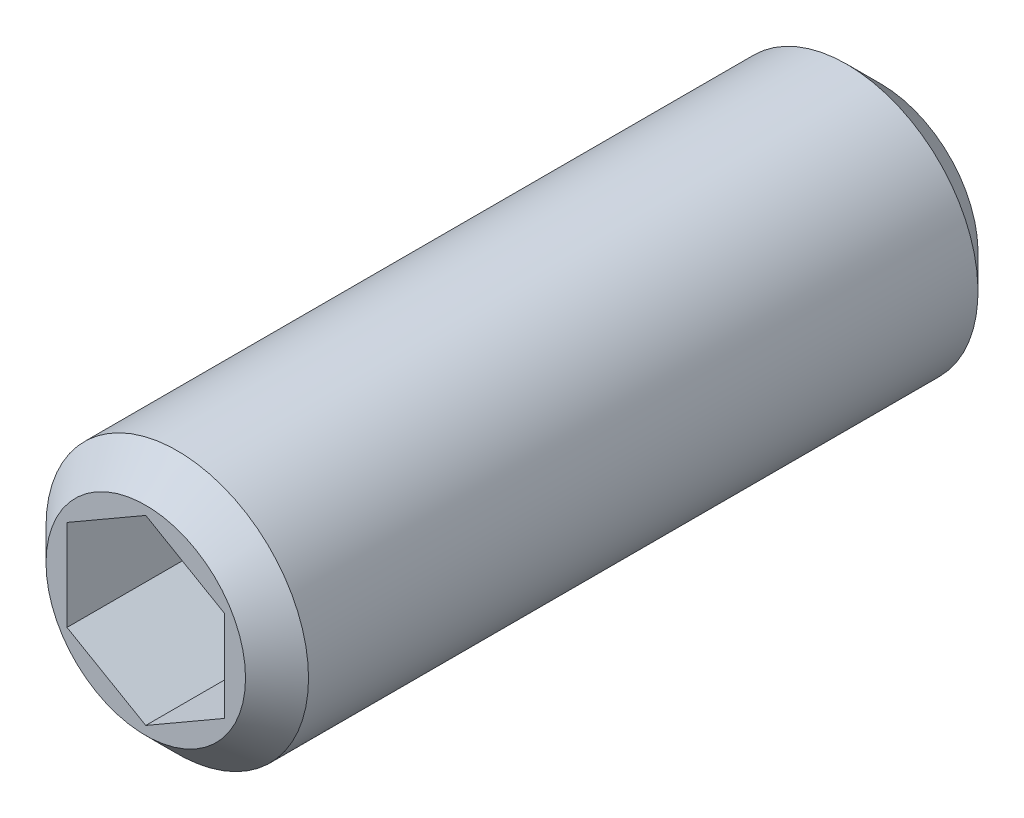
ISO-10303-21;
HEADER;
FILE_DESCRIPTION(('STEP AP214'),'2;1');
FILE_NAME('part.step','',(''),(''),'','','');
FILE_SCHEMA(('AUTOMOTIVE_DESIGN { 1 0 10303 214 1 1 1 1 }'));
ENDSEC;
DATA;
#1=APPLICATION_CONTEXT('core data for automotive mechanical design processes');
#2=APPLICATION_PROTOCOL_DEFINITION('international standard','automotive_design',2000,#1);
#3=PRODUCT_CONTEXT('',#1,'mechanical');
#4=PRODUCT('Part','Part','',(#3));
#5=PRODUCT_RELATED_PRODUCT_CATEGORY('part','',(#4));
#6=PRODUCT_DEFINITION_FORMATION('','',#4);
#7=PRODUCT_DEFINITION_CONTEXT('part definition',#1,'design');
#8=PRODUCT_DEFINITION('design','',#6,#7);
#9=PRODUCT_DEFINITION_SHAPE('','',#8);
#10=(LENGTH_UNIT() NAMED_UNIT(*) SI_UNIT(.MILLI.,.METRE.));
#11=(NAMED_UNIT(*) PLANE_ANGLE_UNIT() SI_UNIT($,.RADIAN.));
#12=(NAMED_UNIT(*) SI_UNIT($,.STERADIAN.) SOLID_ANGLE_UNIT());
#13=UNCERTAINTY_MEASURE_WITH_UNIT(LENGTH_MEASURE(1.E-05),#10,'distance_accuracy_value','');
#14=(GEOMETRIC_REPRESENTATION_CONTEXT(3) GLOBAL_UNCERTAINTY_ASSIGNED_CONTEXT((#13)) GLOBAL_UNIT_ASSIGNED_CONTEXT((#10,
#11,#12)) REPRESENTATION_CONTEXT('',''));
#15=CARTESIAN_POINT('',(0.,0.,0.));
#16=DIRECTION('',(0.,0.,1.));
#17=DIRECTION('',(1.,0.,0.));
#18=AXIS2_PLACEMENT_3D('',#15,#16,#17);
#19=CARTESIAN_POINT('',(0.,0.,0.9));
#20=DIRECTION('',(0.,0.,1.));
#21=DIRECTION('',(0.,-1.,0.));
#22=AXIS2_PLACEMENT_3D('',#19,#20,#21);
#23=CYLINDRICAL_SURFACE('',#22,2.5);
#24=CARTESIAN_POINT('',(0.,0.,14.3));
#25=DIRECTION('',(0.,0.,-1.));
#26=DIRECTION('',(-1.,0.,0.));
#27=AXIS2_PLACEMENT_3D('',#24,#25,#26);
#28=CIRCLE('',#27,2.5);
#29=CARTESIAN_POINT('',(-2.5,0.,14.3));
#30=VERTEX_POINT('',#29);
#31=EDGE_CURVE('E22',#30,#30,#28,.T.);
#32=ORIENTED_EDGE('',*,*,#31,.T.);
#33=EDGE_LOOP('',(#32));
#34=FACE_BOUND('',#33,.T.);
#35=CARTESIAN_POINT('',(0.,0.,1.55));
#36=DIRECTION('',(0.,0.,-1.));
#37=DIRECTION('',(-1.,0.,0.));
#38=AXIS2_PLACEMENT_3D('',#35,#36,#37);
#39=CIRCLE('',#38,2.5);
#40=CARTESIAN_POINT('',(-2.5,0.,1.55));
#41=VERTEX_POINT('',#40);
#42=EDGE_CURVE('E181',#41,#41,#39,.T.);
#43=ORIENTED_EDGE('',*,*,#42,.F.);
#44=EDGE_LOOP('',(#43));
#45=FACE_BOUND('',#44,.T.);
#46=ADVANCED_FACE('F14',(#34,#45),#23,.T.);
#47=CARTESIAN_POINT('',(0.,0.,0.9));
#48=DIRECTION('',(0.,0.,1.));
#49=DIRECTION('',(1.,0.,0.));
#50=AXIS2_PLACEMENT_3D('',#47,#48,#49);
#51=CONICAL_SURFACE('',#50,1.85,0.785398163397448);
#52=ORIENTED_EDGE('',*,*,#42,.T.);
#53=EDGE_LOOP('',(#52));
#54=FACE_BOUND('',#53,.T.);
#55=CARTESIAN_POINT('',(0.,0.,0.9));
#56=DIRECTION('',(0.,0.,-1.));
#57=DIRECTION('',(0.,1.,0.));
#58=AXIS2_PLACEMENT_3D('',#55,#56,#57);
#59=CIRCLE('',#58,1.85);
#60=CARTESIAN_POINT('',(0.,1.85,0.9));
#61=VERTEX_POINT('',#60);
#62=EDGE_CURVE('E116',#61,#61,#59,.F.);
#63=ORIENTED_EDGE('',*,*,#62,.T.);
#64=EDGE_LOOP('',(#63));
#65=FACE_BOUND('',#64,.T.);
#66=ADVANCED_FACE('F142',(#54,#65),#51,.T.);
#67=CARTESIAN_POINT('',(0.,0.,1.5));
#68=DIRECTION('',(0.,0.,-1.));
#69=DIRECTION('',(1.,0.,0.));
#70=AXIS2_PLACEMENT_3D('',#67,#68,#69);
#71=SPHERICAL_SURFACE('',#70,1.5);
#72=CARTESIAN_POINT('',(0.,0.,0.9));
#73=DIRECTION('',(0.,0.,-1.));
#74=DIRECTION('',(0.,1.,0.));
#75=AXIS2_PLACEMENT_3D('',#72,#73,#74);
#76=CIRCLE('',#75,1.37477270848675);
#77=CARTESIAN_POINT('',(0.,1.37477270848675,0.9));
#78=VERTEX_POINT('',#77);
#79=EDGE_CURVE('E123',#78,#78,#76,.F.);
#80=ORIENTED_EDGE('',*,*,#79,.F.);
#81=EDGE_LOOP('',(#80));
#82=FACE_BOUND('',#81,.T.);
#83=ADVANCED_FACE('F146',(#82),#71,.T.);
#84=CARTESIAN_POINT('',(0.,0.,0.9));
#85=DIRECTION('',(0.,0.,-1.));
#86=DIRECTION('',(0.,1.,0.));
#87=AXIS2_PLACEMENT_3D('',#84,#85,#86);
#88=PLANE('',#87);
#89=ORIENTED_EDGE('',*,*,#62,.F.);
#90=EDGE_LOOP('',(#89));
#91=FACE_BOUND('',#90,.T.);
#92=ORIENTED_EDGE('',*,*,#79,.T.);
#93=EDGE_LOOP('',(#92));
#94=FACE_BOUND('',#93,.T.);
#95=ADVANCED_FACE('F150',(#91,#94),#88,.T.);
#96=CARTESIAN_POINT('',(-1.5,-0.866025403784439,11.9));
#97=DIRECTION('',(0.,0.,-1.));
#98=DIRECTION('',(0.,1.,0.));
#99=AXIS2_PLACEMENT_3D('',#96,#97,#98);
#100=PLANE('',#99);
#101=DIRECTION('',(0.866025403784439,-0.5,0.));
#102=VECTOR('',#101,1.);
#103=CARTESIAN_POINT('',(-1.5,-0.866025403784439,11.9));
#104=LINE('',#103,#102);
#105=CARTESIAN_POINT('',(-1.5,-0.866025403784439,11.9));
#106=VERTEX_POINT('',#105);
#107=CARTESIAN_POINT('',(0.,-1.73205080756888,11.9));
#108=VERTEX_POINT('',#107);
#109=EDGE_CURVE('E100',#106,#108,#104,.T.);
#110=ORIENTED_EDGE('',*,*,#109,.T.);
#111=DIRECTION('',(0.866025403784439,0.5,0.));
#112=VECTOR('',#111,1.);
#113=CARTESIAN_POINT('',(0.,-1.73205080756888,11.9));
#114=LINE('',#113,#112);
#115=CARTESIAN_POINT('',(1.5,-0.866025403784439,11.9));
#116=VERTEX_POINT('',#115);
#117=EDGE_CURVE('E103',#108,#116,#114,.T.);
#118=ORIENTED_EDGE('',*,*,#117,.T.);
#119=DIRECTION('',(0.,1.,0.));
#120=VECTOR('',#119,1.);
#121=CARTESIAN_POINT('',(1.5,-0.866025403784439,11.9));
#122=LINE('',#121,#120);
#123=CARTESIAN_POINT('',(1.5,0.866025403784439,11.9));
#124=VERTEX_POINT('',#123);
#125=EDGE_CURVE('E75',#116,#124,#122,.T.);
#126=ORIENTED_EDGE('',*,*,#125,.T.);
#127=DIRECTION('',(-0.866025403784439,0.5,0.));
#128=VECTOR('',#127,1.);
#129=CARTESIAN_POINT('',(1.5,0.866025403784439,11.9));
#130=LINE('',#129,#128);
#131=CARTESIAN_POINT('',(0.,1.73205080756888,11.9));
#132=VERTEX_POINT('',#131);
#133=EDGE_CURVE('E106',#124,#132,#130,.T.);
#134=ORIENTED_EDGE('',*,*,#133,.T.);
#135=DIRECTION('',(-0.866025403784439,-0.5,0.));
#136=VECTOR('',#135,1.);
#137=CARTESIAN_POINT('',(0.,1.73205080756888,11.9));
#138=LINE('',#137,#136);
#139=CARTESIAN_POINT('',(-1.5,0.866025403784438,11.9));
#140=VERTEX_POINT('',#139);
#141=EDGE_CURVE('E109',#132,#140,#138,.T.);
#142=ORIENTED_EDGE('',*,*,#141,.T.);
#143=DIRECTION('',(0.,-1.,0.));
#144=VECTOR('',#143,1.);
#145=CARTESIAN_POINT('',(-1.5,0.866025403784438,11.9));
#146=LINE('',#145,#144);
#147=EDGE_CURVE('E112',#140,#106,#146,.T.);
#148=ORIENTED_EDGE('',*,*,#147,.T.);
#149=EDGE_LOOP('',(#110,#118,#126,#134,#142,#148));
#150=FACE_BOUND('',#149,.T.);
#151=ADVANCED_FACE('F152',(#150),#100,.F.);
#152=CARTESIAN_POINT('',(1.5,-0.866025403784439,11.9));
#153=DIRECTION('',(1.,0.,0.));
#154=DIRECTION('',(0.,-1.,0.));
#155=AXIS2_PLACEMENT_3D('',#152,#153,#154);
#156=PLANE('',#155);
#157=DIRECTION('',(0.,1.,0.));
#158=VECTOR('',#157,1.);
#159=CARTESIAN_POINT('',(1.5,-0.866025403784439,14.9));
#160=LINE('',#159,#158);
#161=CARTESIAN_POINT('',(1.5,-0.866025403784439,14.9));
#162=VERTEX_POINT('',#161);
#163=CARTESIAN_POINT('',(1.5,0.866025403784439,14.9));
#164=VERTEX_POINT('',#163);
#165=EDGE_CURVE('E72',#162,#164,#160,.T.);
#166=ORIENTED_EDGE('',*,*,#165,.T.);
#167=DIRECTION('',(0.,0.,1.));
#168=VECTOR('',#167,1.);
#169=CARTESIAN_POINT('',(1.5,0.866025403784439,11.9));
#170=LINE('',#169,#168);
#171=EDGE_CURVE('E79',#124,#164,#170,.T.);
#172=ORIENTED_EDGE('',*,*,#171,.F.);
#173=ORIENTED_EDGE('',*,*,#125,.F.);
#174=DIRECTION('',(0.,0.,1.));
#175=VECTOR('',#174,1.);
#176=CARTESIAN_POINT('',(1.5,-0.866025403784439,11.9));
#177=LINE('',#176,#175);
#178=EDGE_CURVE('E68',#116,#162,#177,.T.);
#179=ORIENTED_EDGE('',*,*,#178,.T.);
#180=EDGE_LOOP('',(#166,#172,#173,#179));
#181=FACE_BOUND('',#180,.T.);
#182=ADVANCED_FACE('F70',(#181),#156,.F.);
#183=CARTESIAN_POINT('',(1.5,0.866025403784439,11.9));
#184=DIRECTION('',(0.5,0.866025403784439,0.));
#185=DIRECTION('',(0.866025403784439,-0.5,0.));
#186=AXIS2_PLACEMENT_3D('',#183,#184,#185);
#187=PLANE('',#186);
#188=DIRECTION('',(-0.866025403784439,0.5,0.));
#189=VECTOR('',#188,1.);
#190=CARTESIAN_POINT('',(1.5,0.866025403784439,14.9));
#191=LINE('',#190,#189);
#192=CARTESIAN_POINT('',(0.,1.73205080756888,14.9));
#193=VERTEX_POINT('',#192);
#194=EDGE_CURVE('E90',#164,#193,#191,.T.);
#195=ORIENTED_EDGE('',*,*,#194,.T.);
#196=DIRECTION('',(0.,0.,1.));
#197=VECTOR('',#196,1.);
#198=CARTESIAN_POINT('',(0.,1.73205080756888,11.9));
#199=LINE('',#198,#197);
#200=EDGE_CURVE('E119',#132,#193,#199,.T.);
#201=ORIENTED_EDGE('',*,*,#200,.F.);
#202=ORIENTED_EDGE('',*,*,#133,.F.);
#203=ORIENTED_EDGE('',*,*,#171,.T.);
#204=EDGE_LOOP('',(#195,#201,#202,#203));
#205=FACE_BOUND('',#204,.T.);
#206=ADVANCED_FACE('F166',(#205),#187,.F.);
#207=CARTESIAN_POINT('',(0.,1.73205080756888,11.9));
#208=DIRECTION('',(-0.5,0.866025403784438,0.));
#209=DIRECTION('',(0.866025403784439,0.5,0.));
#210=AXIS2_PLACEMENT_3D('',#207,#208,#209);
#211=PLANE('',#210);
#212=DIRECTION('',(-0.866025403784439,-0.5,0.));
#213=VECTOR('',#212,1.);
#214=CARTESIAN_POINT('',(0.,1.73205080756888,14.9));
#215=LINE('',#214,#213);
#216=CARTESIAN_POINT('',(-1.5,0.866025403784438,14.9));
#217=VERTEX_POINT('',#216);
#218=EDGE_CURVE('E92',#193,#217,#215,.T.);
#219=ORIENTED_EDGE('',*,*,#218,.T.);
#220=DIRECTION('',(0.,0.,1.));
#221=VECTOR('',#220,1.);
#222=CARTESIAN_POINT('',(-1.5,0.866025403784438,11.9));
#223=LINE('',#222,#221);
#224=EDGE_CURVE('E117',#140,#217,#223,.T.);
#225=ORIENTED_EDGE('',*,*,#224,.F.);
#226=ORIENTED_EDGE('',*,*,#141,.F.);
#227=ORIENTED_EDGE('',*,*,#200,.T.);
#228=EDGE_LOOP('',(#219,#225,#226,#227));
#229=FACE_BOUND('',#228,.T.);
#230=ADVANCED_FACE('F169',(#229),#211,.F.);
#231=CARTESIAN_POINT('',(-1.5,0.866025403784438,11.9));
#232=DIRECTION('',(-1.,0.,0.));
#233=DIRECTION('',(0.,1.,0.));
#234=AXIS2_PLACEMENT_3D('',#231,#232,#233);
#235=PLANE('',#234);
#236=DIRECTION('',(0.,-1.,0.));
#237=VECTOR('',#236,1.);
#238=CARTESIAN_POINT('',(-1.5,0.866025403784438,14.9));
#239=LINE('',#238,#237);
#240=CARTESIAN_POINT('',(-1.5,-0.866025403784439,14.9));
#241=VERTEX_POINT('',#240);
#242=EDGE_CURVE('E98',#217,#241,#239,.T.);
#243=ORIENTED_EDGE('',*,*,#242,.T.);
#244=DIRECTION('',(0.,0.,1.));
#245=VECTOR('',#244,1.);
#246=CARTESIAN_POINT('',(-1.5,-0.866025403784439,11.9));
#247=LINE('',#246,#245);
#248=EDGE_CURVE('E36',#106,#241,#247,.T.);
#249=ORIENTED_EDGE('',*,*,#248,.F.);
#250=ORIENTED_EDGE('',*,*,#147,.F.);
#251=ORIENTED_EDGE('',*,*,#224,.T.);
#252=EDGE_LOOP('',(#243,#249,#250,#251));
#253=FACE_BOUND('',#252,.T.);
#254=ADVANCED_FACE('F161',(#253),#235,.F.);
#255=CARTESIAN_POINT('',(-1.5,-0.866025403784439,11.9));
#256=DIRECTION('',(-0.5,-0.866025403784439,0.));
#257=DIRECTION('',(-0.866025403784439,0.5,0.));
#258=AXIS2_PLACEMENT_3D('',#255,#256,#257);
#259=PLANE('',#258);
#260=DIRECTION('',(0.866025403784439,-0.5,0.));
#261=VECTOR('',#260,1.);
#262=CARTESIAN_POINT('',(-1.5,-0.866025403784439,14.9));
#263=LINE('',#262,#261);
#264=CARTESIAN_POINT('',(0.,-1.73205080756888,14.9));
#265=VERTEX_POINT('',#264);
#266=EDGE_CURVE('E29',#241,#265,#263,.T.);
#267=ORIENTED_EDGE('',*,*,#266,.T.);
#268=DIRECTION('',(0.,0.,1.));
#269=VECTOR('',#268,1.);
#270=CARTESIAN_POINT('',(0.,-1.73205080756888,11.9));
#271=LINE('',#270,#269);
#272=EDGE_CURVE('E80',#108,#265,#271,.T.);
#273=ORIENTED_EDGE('',*,*,#272,.F.);
#274=ORIENTED_EDGE('',*,*,#109,.F.);
#275=ORIENTED_EDGE('',*,*,#248,.T.);
#276=EDGE_LOOP('',(#267,#273,#274,#275));
#277=FACE_BOUND('',#276,.T.);
#278=ADVANCED_FACE('F158',(#277),#259,.F.);
#279=CARTESIAN_POINT('',(0.,-1.73205080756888,11.9));
#280=DIRECTION('',(0.5,-0.866025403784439,0.));
#281=DIRECTION('',(-0.866025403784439,-0.5,0.));
#282=AXIS2_PLACEMENT_3D('',#279,#280,#281);
#283=PLANE('',#282);
#284=DIRECTION('',(0.866025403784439,0.5,0.));
#285=VECTOR('',#284,1.);
#286=CARTESIAN_POINT('',(0.,-1.73205080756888,14.9));
#287=LINE('',#286,#285);
#288=EDGE_CURVE('E83',#265,#162,#287,.T.);
#289=ORIENTED_EDGE('',*,*,#288,.T.);
#290=ORIENTED_EDGE('',*,*,#178,.F.);
#291=ORIENTED_EDGE('',*,*,#117,.F.);
#292=ORIENTED_EDGE('',*,*,#272,.T.);
#293=EDGE_LOOP('',(#289,#290,#291,#292));
#294=FACE_BOUND('',#293,.T.);
#295=ADVANCED_FACE('F84',(#294),#283,.F.);
#296=CARTESIAN_POINT('',(0.,0.,14.9));
#297=DIRECTION('',(0.,0.,-1.));
#298=DIRECTION('',(0.,1.,0.));
#299=AXIS2_PLACEMENT_3D('',#296,#297,#298);
#300=PLANE('',#299);
#301=CARTESIAN_POINT('',(0.,0.,14.9));
#302=DIRECTION('',(0.,0.,-1.));
#303=DIRECTION('',(-1.,0.,0.));
#304=AXIS2_PLACEMENT_3D('',#301,#302,#303);
#305=CIRCLE('',#304,1.9);
#306=CARTESIAN_POINT('',(-1.9,0.,14.9));
#307=VERTEX_POINT('',#306);
#308=EDGE_CURVE('E9',#307,#307,#305,.F.);
#309=ORIENTED_EDGE('',*,*,#308,.T.);
#310=EDGE_LOOP('',(#309));
#311=FACE_BOUND('',#310,.T.);
#312=ORIENTED_EDGE('',*,*,#288,.F.);
#313=ORIENTED_EDGE('',*,*,#266,.F.);
#314=ORIENTED_EDGE('',*,*,#242,.F.);
#315=ORIENTED_EDGE('',*,*,#218,.F.);
#316=ORIENTED_EDGE('',*,*,#194,.F.);
#317=ORIENTED_EDGE('',*,*,#165,.F.);
#318=EDGE_LOOP('',(#312,#313,#314,#315,#316,#317));
#319=FACE_BOUND('',#318,.T.);
#320=ADVANCED_FACE('F87',(#311,#319),#300,.F.);
#321=CARTESIAN_POINT('',(0.,0.,14.3));
#322=DIRECTION('',(0.,0.,-1.));
#323=DIRECTION('',(-1.,0.,0.));
#324=AXIS2_PLACEMENT_3D('',#321,#322,#323);
#325=CONICAL_SURFACE('',#324,2.5,0.785398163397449);
#326=ORIENTED_EDGE('',*,*,#308,.F.);
#327=EDGE_LOOP('',(#326));
#328=FACE_BOUND('',#327,.T.);
#329=ORIENTED_EDGE('',*,*,#31,.F.);
#330=EDGE_LOOP('',(#329));
#331=FACE_BOUND('',#330,.T.);
#332=ADVANCED_FACE('F16',(#328,#331),#325,.T.);
#333=CLOSED_SHELL('',(#46,#66,#83,#95,#151,#182,#206,#230,#254,#278,#295,#320,#332));
#334=MANIFOLD_SOLID_BREP('B1',#333);
#335=ADVANCED_BREP_SHAPE_REPRESENTATION('',(#18,#334),#14);
#336=SHAPE_DEFINITION_REPRESENTATION(#9,#335);
ENDSEC;
END-ISO-10303-21;
